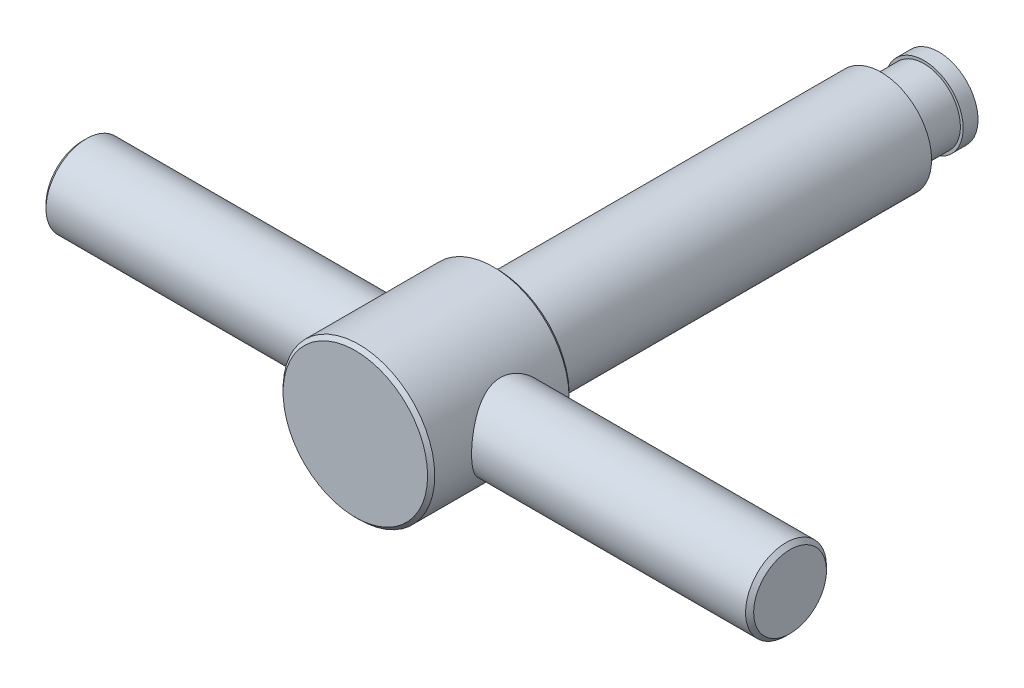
ISO-10303-21;
HEADER;
FILE_DESCRIPTION(('STEP AP214'),'2;1');
FILE_NAME('part.step','',(''),(''),'','','');
FILE_SCHEMA(('AUTOMOTIVE_DESIGN { 1 0 10303 214 1 1 1 1 }'));
ENDSEC;
DATA;
#1=APPLICATION_CONTEXT('core data for automotive mechanical design processes');
#2=APPLICATION_PROTOCOL_DEFINITION('international standard','automotive_design',2000,#1);
#3=PRODUCT_CONTEXT('',#1,'mechanical');
#4=PRODUCT('Part','Part','',(#3));
#5=PRODUCT_RELATED_PRODUCT_CATEGORY('part','',(#4));
#6=PRODUCT_DEFINITION_FORMATION('','',#4);
#7=PRODUCT_DEFINITION_CONTEXT('part definition',#1,'design');
#8=PRODUCT_DEFINITION('design','',#6,#7);
#9=PRODUCT_DEFINITION_SHAPE('','',#8);
#10=(LENGTH_UNIT() NAMED_UNIT(*) SI_UNIT(.MILLI.,.METRE.));
#11=(NAMED_UNIT(*) PLANE_ANGLE_UNIT() SI_UNIT($,.RADIAN.));
#12=(NAMED_UNIT(*) SI_UNIT($,.STERADIAN.) SOLID_ANGLE_UNIT());
#13=UNCERTAINTY_MEASURE_WITH_UNIT(LENGTH_MEASURE(1.E-05),#10,'distance_accuracy_value','');
#14=(GEOMETRIC_REPRESENTATION_CONTEXT(3) GLOBAL_UNCERTAINTY_ASSIGNED_CONTEXT((#13)) GLOBAL_UNIT_ASSIGNED_CONTEXT((#10,
#11,#12)) REPRESENTATION_CONTEXT('',''));
#15=CARTESIAN_POINT('',(0.,0.,0.));
#16=DIRECTION('',(0.,0.,1.));
#17=DIRECTION('',(1.,0.,0.));
#18=AXIS2_PLACEMENT_3D('',#15,#16,#17);
#19=CARTESIAN_POINT('',(70.,0.,109.2));
#20=DIRECTION('',(-1.,0.,0.));
#21=DIRECTION('',(0.,-1.,0.));
#22=AXIS2_PLACEMENT_3D('',#19,#20,#21);
#23=PLANE('',#22);
#24=CARTESIAN_POINT('',(70.,0.,102.));
#25=DIRECTION('',(-1.,0.,0.));
#26=DIRECTION('',(0.,-1.,0.));
#27=AXIS2_PLACEMENT_3D('',#24,#25,#26);
#28=CIRCLE('',#27,7.2);
#29=CARTESIAN_POINT('',(70.,-7.2,102.));
#30=VERTEX_POINT('',#29);
#31=EDGE_CURVE('E15',#30,#30,#28,.T.);
#32=ORIENTED_EDGE('',*,*,#31,.F.);
#33=EDGE_LOOP('',(#32));
#34=FACE_BOUND('',#33,.T.);
#35=ADVANCED_FACE('F12',(#34),#23,.F.);
#36=CARTESIAN_POINT('',(-70.,0.,102.));
#37=DIRECTION('',(1.,0.,0.));
#38=DIRECTION('',(0.,1.,0.));
#39=AXIS2_PLACEMENT_3D('',#36,#37,#38);
#40=PLANE('',#39);
#41=CARTESIAN_POINT('',(-70.,0.,102.));
#42=DIRECTION('',(1.,0.,0.));
#43=DIRECTION('',(0.,1.,0.));
#44=AXIS2_PLACEMENT_3D('',#41,#42,#43);
#45=CIRCLE('',#44,7.2);
#46=CARTESIAN_POINT('',(-70.,7.2,102.));
#47=VERTEX_POINT('',#46);
#48=EDGE_CURVE('E130',#47,#47,#45,.T.);
#49=ORIENTED_EDGE('',*,*,#48,.F.);
#50=EDGE_LOOP('',(#49));
#51=FACE_BOUND('',#50,.T.);
#52=ADVANCED_FACE('F167',(#51),#40,.F.);
#53=CARTESIAN_POINT('',(0.,0.,13.));
#54=DIRECTION('',(-1.,0.,0.));
#55=DIRECTION('',(0.,1.,0.));
#56=AXIS2_PLACEMENT_3D('',#53,#54,#55);
#57=SPHERICAL_SURFACE('',#56,13.);
#58=CARTESIAN_POINT('',(0.,0.,2.56268712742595));
#59=DIRECTION('',(0.,0.,1.));
#60=DIRECTION('',(0.,-1.,0.));
#61=AXIS2_PLACEMENT_3D('',#58,#59,#60);
#62=CIRCLE('',#61,7.75);
#63=CARTESIAN_POINT('',(0.,-7.75,2.56268712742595));
#64=VERTEX_POINT('',#63);
#65=EDGE_CURVE('E123',#64,#64,#62,.T.);
#66=ORIENTED_EDGE('',*,*,#65,.F.);
#67=EDGE_LOOP('',(#66));
#68=FACE_BOUND('',#67,.T.);
#69=ADVANCED_FACE('F164',(#68),#57,.T.);
#70=CARTESIAN_POINT('',(69.2,0.,102.));
#71=DIRECTION('',(-1.,0.,0.));
#72=DIRECTION('',(0.,-1.,0.));
#73=AXIS2_PLACEMENT_3D('',#70,#71,#72);
#74=CONICAL_SURFACE('',#73,8.,0.785398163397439);
#75=CARTESIAN_POINT('',(69.2,0.,102.));
#76=DIRECTION('',(-1.,0.,0.));
#77=DIRECTION('',(0.,-1.,0.));
#78=AXIS2_PLACEMENT_3D('',#75,#76,#77);
#79=CIRCLE('',#78,8.);
#80=CARTESIAN_POINT('',(69.2,-8.,102.));
#81=VERTEX_POINT('',#80);
#82=EDGE_CURVE('E121',#81,#81,#79,.T.);
#83=ORIENTED_EDGE('',*,*,#82,.F.);
#84=EDGE_LOOP('',(#83));
#85=FACE_BOUND('',#84,.T.);
#86=ORIENTED_EDGE('',*,*,#31,.T.);
#87=EDGE_LOOP('',(#86));
#88=FACE_BOUND('',#87,.T.);
#89=ADVANCED_FACE('F160',(#85,#88),#74,.T.);
#90=CARTESIAN_POINT('',(0.,0.,118.));
#91=DIRECTION('',(0.,0.,-1.));
#92=DIRECTION('',(0.,1.,0.));
#93=AXIS2_PLACEMENT_3D('',#90,#91,#92);
#94=PLANE('',#93);
#95=CARTESIAN_POINT('',(0.,0.,118.));
#96=DIRECTION('',(0.,0.,-1.));
#97=DIRECTION('',(1.,0.,0.));
#98=AXIS2_PLACEMENT_3D('',#95,#96,#97);
#99=CIRCLE('',#98,14.2928932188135);
#100=CARTESIAN_POINT('',(14.2928932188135,0.,118.));
#101=VERTEX_POINT('',#100);
#102=EDGE_CURVE('E118',#101,#101,#99,.T.);
#103=ORIENTED_EDGE('',*,*,#102,.F.);
#104=EDGE_LOOP('',(#103));
#105=FACE_BOUND('',#104,.T.);
#106=ADVANCED_FACE('F156',(#105),#94,.F.);
#107=CARTESIAN_POINT('',(-69.2,0.,102.));
#108=DIRECTION('',(1.,0.,0.));
#109=DIRECTION('',(0.,1.,0.));
#110=AXIS2_PLACEMENT_3D('',#107,#108,#109);
#111=CONICAL_SURFACE('',#110,8.,0.785398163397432);
#112=ORIENTED_EDGE('',*,*,#48,.T.);
#113=EDGE_LOOP('',(#112));
#114=FACE_BOUND('',#113,.T.);
#115=CARTESIAN_POINT('',(-69.2,0.,102.));
#116=DIRECTION('',(-1.,0.,0.));
#117=DIRECTION('',(0.,-1.,0.));
#118=AXIS2_PLACEMENT_3D('',#115,#116,#117);
#119=CIRCLE('',#118,8.);
#120=CARTESIAN_POINT('',(-69.2,-8.,102.));
#121=VERTEX_POINT('',#120);
#122=EDGE_CURVE('E114',#121,#121,#119,.F.);
#123=ORIENTED_EDGE('',*,*,#122,.F.);
#124=EDGE_LOOP('',(#123));
#125=FACE_BOUND('',#124,.T.);
#126=ADVANCED_FACE('F150',(#114,#125),#111,.T.);
#127=CARTESIAN_POINT('',(0.,0.,0.));
#128=DIRECTION('',(0.,0.,1.));
#129=DIRECTION('',(0.,-1.,0.));
#130=AXIS2_PLACEMENT_3D('',#127,#128,#129);
#131=CYLINDRICAL_SURFACE('',#130,7.75);
#132=CARTESIAN_POINT('',(0.,0.,5.5));
#133=DIRECTION('',(0.,0.,1.));
#134=DIRECTION('',(0.,-1.,0.));
#135=AXIS2_PLACEMENT_3D('',#132,#133,#134);
#136=CIRCLE('',#135,7.75);
#137=CARTESIAN_POINT('',(0.,-7.75,5.5));
#138=VERTEX_POINT('',#137);
#139=EDGE_CURVE('E117',#138,#138,#136,.F.);
#140=ORIENTED_EDGE('',*,*,#139,.T.);
#141=EDGE_LOOP('',(#140));
#142=FACE_BOUND('',#141,.T.);
#143=ORIENTED_EDGE('',*,*,#65,.T.);
#144=EDGE_LOOP('',(#143));
#145=FACE_BOUND('',#144,.T.);
#146=ADVANCED_FACE('F144',(#142,#145),#131,.T.);
#147=CARTESIAN_POINT('',(70.,0.,102.));
#148=DIRECTION('',(-1.,0.,0.));
#149=DIRECTION('',(0.,-1.,0.));
#150=AXIS2_PLACEMENT_3D('',#147,#148,#149);
#151=CYLINDRICAL_SURFACE('',#150,8.);
#152=CARTESIAN_POINT('',(12.689294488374,7.99886275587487,101.86511259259));
#153=CARTESIAN_POINT('',(12.6915005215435,7.99536276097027,101.657535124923));
#154=CARTESIAN_POINT('',(12.698815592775,7.98377231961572,101.4501531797));
#155=CARTESIAN_POINT('',(12.7233681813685,7.94458516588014,101.037422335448));
#156=CARTESIAN_POINT('',(12.7406097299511,7.91698195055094,100.832074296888));
#157=CARTESIAN_POINT('',(12.7843716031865,7.84611824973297,100.424812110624));
#158=CARTESIAN_POINT('',(12.8109052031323,7.80283536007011,100.22290331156));
#159=CARTESIAN_POINT('',(12.8722778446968,7.7011676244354,99.8241368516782));
#160=CARTESIAN_POINT('',(12.9071206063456,7.64277601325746,99.6272814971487));
#161=CARTESIAN_POINT('',(12.983665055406,7.51199941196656,99.2411706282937));
#162=CARTESIAN_POINT('',(13.0253198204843,7.43970959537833,99.0518734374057));
#163=CARTESIAN_POINT('',(13.1143932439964,7.28154717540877,98.680383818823));
#164=CARTESIAN_POINT('',(13.1618139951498,7.19566963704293,98.4981940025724));
#165=CARTESIAN_POINT('',(13.2610944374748,7.01101575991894,98.141772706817));
#166=CARTESIAN_POINT('',(13.3129533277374,6.91224174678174,97.9675398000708));
#167=CARTESIAN_POINT('',(13.4197993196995,6.70245383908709,97.6276958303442));
#168=CARTESIAN_POINT('',(13.4747865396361,6.59143948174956,97.4620850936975));
#169=CARTESIAN_POINT('',(13.6534578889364,6.2180081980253,96.9475959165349));
#170=CARTESIAN_POINT('',(13.7808278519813,5.93298555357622,96.6158151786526));
#171=CARTESIAN_POINT('',(13.9689823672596,5.46769874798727,96.1560269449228));
#172=CARTESIAN_POINT('',(14.0312550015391,5.30619866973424,96.0089982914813));
#173=CARTESIAN_POINT('',(14.1534426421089,4.97109760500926,95.7281643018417));
#174=CARTESIAN_POINT('',(14.2133572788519,4.79749473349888,95.5943610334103));
#175=CARTESIAN_POINT('',(14.3333751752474,4.42661700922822,95.3321545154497));
#176=CARTESIAN_POINT('',(14.3932045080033,4.22853538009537,95.2047658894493));
#177=CARTESIAN_POINT('',(14.5067990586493,3.82067538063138,94.9673562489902));
#178=CARTESIAN_POINT('',(14.5605669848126,3.61090229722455,94.8573274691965));
#179=CARTESIAN_POINT('',(14.6604907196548,3.18098894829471,94.6557745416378));
#180=CARTESIAN_POINT('',(14.7066493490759,2.96085256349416,94.5642435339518));
#181=CARTESIAN_POINT('',(14.7899668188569,2.51177337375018,94.4007850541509));
#182=CARTESIAN_POINT('',(14.8271268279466,2.28283171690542,94.3288550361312));
#183=CARTESIAN_POINT('',(14.8884993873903,1.83808610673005,94.2109230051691));
#184=CARTESIAN_POINT('',(14.9135510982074,1.62284762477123,94.1632221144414));
#185=CARTESIAN_POINT('',(14.9544481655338,1.18831227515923,94.0856706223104));
#186=CARTESIAN_POINT('',(14.9702940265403,0.969015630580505,94.0558190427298));
#187=CARTESIAN_POINT('',(14.9923149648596,0.528336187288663,94.0143994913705));
#188=CARTESIAN_POINT('',(14.9984951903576,0.306954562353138,94.0028217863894));
#189=CARTESIAN_POINT('',(15.0010180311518,-0.136055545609,93.9980909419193));
#190=CARTESIAN_POINT('',(14.9973612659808,-0.357684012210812,94.0049366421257));
#191=CARTESIAN_POINT('',(14.981126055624,-0.778417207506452,94.0354359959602));
#192=CARTESIAN_POINT('',(14.9694202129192,-0.977677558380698,94.0574460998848));
#193=CARTESIAN_POINT('',(14.9383067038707,-1.37346486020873,94.116242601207));
#194=CARTESIAN_POINT('',(14.9188964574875,-1.56999087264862,94.1530339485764));
#195=CARTESIAN_POINT('',(14.8728340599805,-1.95886060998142,94.2409669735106));
#196=CARTESIAN_POINT('',(14.8461843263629,-2.15120570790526,94.2921038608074));
#197=CARTESIAN_POINT('',(14.7862300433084,-2.53067624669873,94.4082235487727));
#198=CARTESIAN_POINT('',(14.7529229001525,-2.71779962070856,94.4732117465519));
#199=CARTESIAN_POINT('',(14.6796612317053,-3.08935153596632,94.617830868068));
#200=CARTESIAN_POINT('',(14.6395886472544,-3.27365430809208,94.6977251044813));
#201=CARTESIAN_POINT('',(14.5541371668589,-3.63477338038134,94.8705866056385));
#202=CARTESIAN_POINT('',(14.5087564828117,-3.81158713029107,94.9635582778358));
#203=CARTESIAN_POINT('',(14.366052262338,-4.32949358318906,95.2610182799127));
#204=CARTESIAN_POINT('',(14.2621230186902,-4.65826391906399,95.4841350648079));
#205=CARTESIAN_POINT('',(14.0332510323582,-5.31033875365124,96.0007245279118));
#206=CARTESIAN_POINT('',(13.9072489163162,-5.62934769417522,96.2991547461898));
#207=CARTESIAN_POINT('',(13.7186181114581,-6.06836546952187,96.7824852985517));
#208=CARTESIAN_POINT('',(13.6557521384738,-6.20821998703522,96.9496939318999));
#209=CARTESIAN_POINT('',(13.5316987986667,-6.4741501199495,97.2954360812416));
#210=CARTESIAN_POINT('',(13.4705117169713,-6.60022340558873,97.4739715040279));
#211=CARTESIAN_POINT('',(13.3471818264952,-6.84638984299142,97.8548783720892));
#212=CARTESIAN_POINT('',(13.2852906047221,-6.96538902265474,98.0580396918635));
#213=CARTESIAN_POINT('',(13.167502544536,-7.18557329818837,98.4753502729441));
#214=CARTESIAN_POINT('',(13.1116028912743,-7.28676677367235,98.6894943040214));
#215=CARTESIAN_POINT('',(13.0079356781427,-7.47025544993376,99.1274405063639));
#216=CARTESIAN_POINT('',(12.9601615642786,-7.55256590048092,99.351234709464));
#217=CARTESIAN_POINT('',(12.8747418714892,-7.69727883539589,99.8070470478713));
#218=CARTESIAN_POINT('',(12.8370945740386,-7.7596846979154,100.039063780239));
#219=CARTESIAN_POINT('',(12.7766247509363,-7.85881118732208,100.487742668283));
#220=CARTESIAN_POINT('',(12.7527587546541,-7.89736348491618,100.703859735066));
#221=CARTESIAN_POINT('',(12.715875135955,-7.95661670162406,101.139450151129));
#222=CARTESIAN_POINT('',(12.7028567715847,-7.97731884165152,101.358923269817));
#223=CARTESIAN_POINT('',(12.6882634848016,-8.00050992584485,101.799062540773));
#224=CARTESIAN_POINT('',(12.6866808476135,-8.00301114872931,102.019727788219));
#225=CARTESIAN_POINT('',(12.6950135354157,-7.98978692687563,102.46028233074));
#226=CARTESIAN_POINT('',(12.7049279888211,-7.97406286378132,102.680171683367));
#227=CARTESIAN_POINT('',(12.7338390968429,-7.92779706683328,103.089466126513));
#228=CARTESIAN_POINT('',(12.7515286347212,-7.89938068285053,103.279209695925));
#229=CARTESIAN_POINT('',(12.7947377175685,-7.82920080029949,103.655364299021));
#230=CARTESIAN_POINT('',(12.8202598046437,-7.78743296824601,103.841774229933));
#231=CARTESIAN_POINT('',(12.8783315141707,-7.69101670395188,104.210089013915));
#232=CARTESIAN_POINT('',(12.910880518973,-7.63636940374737,104.391994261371));
#233=CARTESIAN_POINT('',(12.982063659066,-7.51471774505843,104.750433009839));
#234=CARTESIAN_POINT('',(13.0207002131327,-7.44770847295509,104.926964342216));
#235=CARTESIAN_POINT('',(13.1488722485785,-7.22069987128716,105.466897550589));
#236=CARTESIAN_POINT('',(13.2472287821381,-7.04015992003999,105.819794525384));
#237=CARTESIAN_POINT('',(13.4565981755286,-6.63118330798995,106.492508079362));
#238=CARTESIAN_POINT('',(13.5676179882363,-6.40272027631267,106.812306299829));
#239=CARTESIAN_POINT('',(13.7446246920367,-6.0091681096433,107.285855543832));
#240=CARTESIAN_POINT('',(13.8096255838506,-5.85860208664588,107.452258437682));
#241=CARTESIAN_POINT('',(13.9389400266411,-5.54390231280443,107.77195170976));
#242=CARTESIAN_POINT('',(14.0032537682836,-5.37977244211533,107.925245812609));
#243=CARTESIAN_POINT('',(14.1296197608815,-5.03854925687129,108.218006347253));
#244=CARTESIAN_POINT('',(14.1916701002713,-4.86144534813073,108.357461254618));
#245=CARTESIAN_POINT('',(14.3118643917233,-4.49529134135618,108.6214246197));
#246=CARTESIAN_POINT('',(14.370010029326,-4.30624646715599,108.745939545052));
#247=CARTESIAN_POINT('',(14.4826332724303,-3.91111396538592,108.98268149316));
#248=CARTESIAN_POINT('',(14.5369434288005,-3.70468126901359,109.094413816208));
#249=CARTESIAN_POINT('',(14.638318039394,-3.28131316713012,109.29988650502));
#250=CARTESIAN_POINT('',(14.6853822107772,-3.06437735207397,109.393626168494));
#251=CARTESIAN_POINT('',(14.7708257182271,-2.62172979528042,109.561914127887));
#252=CARTESIAN_POINT('',(14.8092123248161,-2.39602558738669,109.636478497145));
#253=CARTESIAN_POINT('',(14.8761439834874,-1.93752040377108,109.765481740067));
#254=CARTESIAN_POINT('',(14.9046904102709,-1.70472042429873,109.819923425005));
#255=CARTESIAN_POINT('',(14.9486186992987,-1.25847496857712,109.903310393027));
#256=CARTESIAN_POINT('',(14.9650560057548,-1.04551498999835,109.934308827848));
#257=CARTESIAN_POINT('',(14.9888266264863,-0.61728844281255,109.97905300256));
#258=CARTESIAN_POINT('',(14.9961605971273,-0.402022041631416,109.992799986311));
#259=CARTESIAN_POINT('',(15.0015197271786,0.028960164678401,110.002850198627));
#260=CARTESIAN_POINT('',(14.9995479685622,0.244675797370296,109.999159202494));
#261=CARTESIAN_POINT('',(14.986357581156,0.674817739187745,109.974398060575));
#262=CARTESIAN_POINT('',(14.9751392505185,0.889244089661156,109.953328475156));
#263=CARTESIAN_POINT('',(14.9449461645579,1.29907532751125,109.896325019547));
#264=CARTESIAN_POINT('',(14.9266159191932,1.49470112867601,109.861623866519));
#265=CARTESIAN_POINT('',(14.8827292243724,1.88212313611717,109.777975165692));
#266=CARTESIAN_POINT('',(14.8571703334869,2.07391802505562,109.729022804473));
#267=CARTESIAN_POINT('',(14.7994088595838,2.45237301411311,109.617399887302));
#268=CARTESIAN_POINT('',(14.7672082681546,2.63903463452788,109.554733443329));
#269=CARTESIAN_POINT('',(14.6968369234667,3.00632106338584,109.416237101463));
#270=CARTESIAN_POINT('',(14.6586638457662,3.18694348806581,109.340402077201));
#271=CARTESIAN_POINT('',(14.5753142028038,3.54912314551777,109.172539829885));
#272=CARTESIAN_POINT('',(14.5299005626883,3.73036002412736,109.079939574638));
#273=CARTESIAN_POINT('',(14.4343837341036,4.08438470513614,108.881785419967));
#274=CARTESIAN_POINT('',(14.3842789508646,4.25716960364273,108.776227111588));
#275=CARTESIAN_POINT('',(14.2804213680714,4.59353407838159,108.552878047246));
#276=CARTESIAN_POINT('',(14.2266678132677,4.75711173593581,108.435084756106));
#277=CARTESIAN_POINT('',(14.1166098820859,5.07439931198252,108.187965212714));
#278=CARTESIAN_POINT('',(14.0603053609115,5.228108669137,108.058638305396));
#279=CARTESIAN_POINT('',(13.9399234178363,5.5416406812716,107.774070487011));
#280=CARTESIAN_POINT('',(13.8756786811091,5.70023771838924,107.617547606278));
#281=CARTESIAN_POINT('',(13.7470505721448,6.00381408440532,107.291859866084));
#282=CARTESIAN_POINT('',(13.6826671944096,6.14879286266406,107.122694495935));
#283=CARTESIAN_POINT('',(13.5553846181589,6.42453340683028,106.772327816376));
#284=CARTESIAN_POINT('',(13.4924869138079,6.55528130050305,106.591115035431));
#285=CARTESIAN_POINT('',(13.369992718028,6.80163406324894,106.217563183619));
#286=CARTESIAN_POINT('',(13.3103967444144,6.91723656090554,106.025222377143));
#287=CARTESIAN_POINT('',(13.1937787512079,7.13725424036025,105.621436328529));
#288=CARTESIAN_POINT('',(13.1369921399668,7.24093489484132,105.409521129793));
#289=CARTESIAN_POINT('',(13.0311666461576,7.42969787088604,104.975816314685));
#290=CARTESIAN_POINT('',(12.9821236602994,7.5147900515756,104.754032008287));
#291=CARTESIAN_POINT('',(12.893911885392,7.66515673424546,104.302569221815));
#292=CARTESIAN_POINT('',(12.85471792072,7.73048185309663,104.072912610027));
#293=CARTESIAN_POINT('',(12.787887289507,7.84054245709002,103.607196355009));
#294=CARTESIAN_POINT('',(12.7602428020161,7.88529187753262,103.371141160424));
#295=CARTESIAN_POINT('',(12.7204492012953,7.94930196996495,102.923741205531));
#296=CARTESIAN_POINT('',(12.7068270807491,7.97099628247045,102.712872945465));
#297=CARTESIAN_POINT('',(12.6901221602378,7.99756562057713,102.289639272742));
#298=CARTESIAN_POINT('',(12.6870397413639,8.00244003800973,102.077273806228));
#299=CARTESIAN_POINT('',(12.689294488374,7.99886275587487,101.86511259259));
#300=B_SPLINE_CURVE_WITH_KNOTS('',3,(#152,#153,#154,#155,#156,#157,#158,#159,#160,#161,#162,
#163,#164,#165,#166,#167,#168,#169,#170,#171,#172,#173,#174,#175,#176,#177,#178,#179,#180,#181,
#182,#183,#184,#185,#186,#187,#188,#189,#190,#191,#192,#193,#194,#195,#196,#197,#198,#199,#200,
#201,#202,#203,#204,#205,#206,#207,#208,#209,#210,#211,#212,#213,#214,#215,#216,#217,#218,#219,
#220,#221,#222,#223,#224,#225,#226,#227,#228,#229,#230,#231,#232,#233,#234,#235,#236,#237,#238,
#239,#240,#241,#242,#243,#244,#245,#246,#247,#248,#249,#250,#251,#252,#253,#254,#255,#256,#257,
#258,#259,#260,#261,#262,#263,#264,#265,#266,#267,#268,#269,#270,#271,#272,#273,#274,#275,#276,
#277,#278,#279,#280,#281,#282,#283,#284,#285,#286,#287,#288,#289,#290,#291,#292,#293,#294,#295,
#296,#297,#298,#299),.UNSPECIFIED.,.T.,.F.,(4,2,2,2,2,2,2,2,2,2,2,2,2,2,2,2,2,2,2,2,2,2,2,2,2,2,
2,2,2,2,2,2,2,2,2,2,2,2,2,2,2,2,2,2,2,2,2,2,2,2,2,2,2,2,2,2,2,2,2,2,2,2,2,2,2,2,2,2,2,2,2,2,2,
4),(0.,0.622631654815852,1.24551634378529,1.86929458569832,2.49335262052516,3.1132803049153,
3.73343366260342,4.35347534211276,4.97354047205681,6.3334333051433,7.01422801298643,
7.69512899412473,8.42315420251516,9.15085282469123,9.87828108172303,10.6056148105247,
11.270340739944,11.9350302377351,12.599365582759,13.2636590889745,13.8653947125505,
14.4673320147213,15.069068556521,15.6710399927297,16.2848738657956,16.8989151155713,
18.1263080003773,19.484165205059,20.1642035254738,20.844356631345,21.5737574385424,
22.3028140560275,23.0312798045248,23.7596218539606,24.4211187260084,25.0825703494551,
25.743575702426,26.4045309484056,26.981900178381,27.5594569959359,28.1369630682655,
28.7146991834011,29.9349233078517,31.155820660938,31.8560597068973,32.5560991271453,
33.2567166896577,33.9570298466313,34.6788463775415,35.400691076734,36.1219287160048,
36.843065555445,37.4896930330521,38.1362738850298,38.7826406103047,39.4289864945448,
40.0268786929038,40.6249730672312,41.2228883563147,41.8210369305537,42.4459714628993,
43.071119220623,43.6963967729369,44.321709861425,45.0166630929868,45.7116444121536,
46.4072972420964,47.1030588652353,47.8300331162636,48.5566208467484,49.2813319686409,
50.0055515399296,50.6419091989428,51.2782898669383),.UNSPECIFIED.);
#301=CARTESIAN_POINT('',(12.689294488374,7.99886275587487,101.86511259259));
#302=VERTEX_POINT('',#301);
#303=EDGE_CURVE('E46',#302,#302,#300,.T.);
#304=ORIENTED_EDGE('',*,*,#303,.F.);
#305=EDGE_LOOP('',(#304));
#306=FACE_BOUND('',#305,.T.);
#307=ORIENTED_EDGE('',*,*,#82,.T.);
#308=EDGE_LOOP('',(#307));
#309=FACE_BOUND('',#308,.T.);
#310=ADVANCED_FACE('F142',(#306,#309),#151,.T.);
#311=CARTESIAN_POINT('',(0.,0.,117.292893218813));
#312=DIRECTION('',(0.,0.,-1.));
#313=DIRECTION('',(1.,0.,0.));
#314=AXIS2_PLACEMENT_3D('',#311,#312,#313);
#315=CONICAL_SURFACE('',#314,15.0000000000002,0.785398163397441);
#316=ORIENTED_EDGE('',*,*,#102,.T.);
#317=EDGE_LOOP('',(#316));
#318=FACE_BOUND('',#317,.T.);
#319=CARTESIAN_POINT('',(0.,0.,117.292893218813));
#320=DIRECTION('',(0.,0.,1.));
#321=DIRECTION('',(0.,-1.,0.));
#322=AXIS2_PLACEMENT_3D('',#319,#320,#321);
#323=CIRCLE('',#322,15.);
#324=CARTESIAN_POINT('',(0.,-15.,117.292893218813));
#325=VERTEX_POINT('',#324);
#326=EDGE_CURVE('E45',#325,#325,#323,.F.);
#327=ORIENTED_EDGE('',*,*,#326,.F.);
#328=EDGE_LOOP('',(#327));
#329=FACE_BOUND('',#328,.T.);
#330=ADVANCED_FACE('F71',(#318,#329),#315,.T.);
#331=CARTESIAN_POINT('',(70.,0.,102.));
#332=DIRECTION('',(-1.,0.,0.));
#333=DIRECTION('',(0.,-1.,0.));
#334=AXIS2_PLACEMENT_3D('',#331,#332,#333);
#335=CYLINDRICAL_SURFACE('',#334,8.);
#336=ORIENTED_EDGE('',*,*,#122,.T.);
#337=EDGE_LOOP('',(#336));
#338=FACE_BOUND('',#337,.T.);
#339=CARTESIAN_POINT('',(-12.689294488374,7.99886275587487,102.13488740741));
#340=CARTESIAN_POINT('',(-12.6915005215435,7.99536276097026,102.342464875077));
#341=CARTESIAN_POINT('',(-12.698815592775,7.98377231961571,102.5498468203));
#342=CARTESIAN_POINT('',(-12.7233681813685,7.94458516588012,102.962577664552));
#343=CARTESIAN_POINT('',(-12.7406097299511,7.91698195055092,103.167925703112));
#344=CARTESIAN_POINT('',(-12.7843716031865,7.84611824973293,103.575187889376));
#345=CARTESIAN_POINT('',(-12.8109052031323,7.80283536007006,103.77709668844));
#346=CARTESIAN_POINT('',(-12.8722778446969,7.70116762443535,104.175863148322));
#347=CARTESIAN_POINT('',(-12.9071206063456,7.64277601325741,104.372718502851));
#348=CARTESIAN_POINT('',(-12.983665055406,7.51199941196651,104.758829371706));
#349=CARTESIAN_POINT('',(-13.0253198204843,7.43970959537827,104.948126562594));
#350=CARTESIAN_POINT('',(-13.1143932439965,7.28154717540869,105.319616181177));
#351=CARTESIAN_POINT('',(-13.1618139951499,7.19566963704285,105.501805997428));
#352=CARTESIAN_POINT('',(-13.2610944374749,7.01101575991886,105.858227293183));
#353=CARTESIAN_POINT('',(-13.3129533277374,6.91224174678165,106.032460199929));
#354=CARTESIAN_POINT('',(-13.4197993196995,6.70245383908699,106.372304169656));
#355=CARTESIAN_POINT('',(-13.4747865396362,6.59143948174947,106.537914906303));
#356=CARTESIAN_POINT('',(-13.6534578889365,6.21800819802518,107.052404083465));
#357=CARTESIAN_POINT('',(-13.7808278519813,5.9329855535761,107.384184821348));
#358=CARTESIAN_POINT('',(-13.9689823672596,5.46769874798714,107.843973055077));
#359=CARTESIAN_POINT('',(-14.0312550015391,5.3061986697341,107.991001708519));
#360=CARTESIAN_POINT('',(-14.153442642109,4.9710976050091,108.271835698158));
#361=CARTESIAN_POINT('',(-14.2133572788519,4.79749473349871,108.40563896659));
#362=CARTESIAN_POINT('',(-14.3333751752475,4.42661700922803,108.66784548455));
#363=CARTESIAN_POINT('',(-14.3932045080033,4.22853538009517,108.795234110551));
#364=CARTESIAN_POINT('',(-14.5067990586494,3.82067538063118,109.03264375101));
#365=CARTESIAN_POINT('',(-14.5605669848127,3.61090229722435,109.142672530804));
#366=CARTESIAN_POINT('',(-14.6604907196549,3.18098894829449,109.344225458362));
#367=CARTESIAN_POINT('',(-14.706649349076,2.96085256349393,109.435756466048));
#368=CARTESIAN_POINT('',(-14.789966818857,2.51177337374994,109.599214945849));
#369=CARTESIAN_POINT('',(-14.8271268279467,2.2828317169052,109.671144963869));
#370=CARTESIAN_POINT('',(-14.8884993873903,1.83808610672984,109.789076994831));
#371=CARTESIAN_POINT('',(-14.9135510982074,1.62284762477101,109.836777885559));
#372=CARTESIAN_POINT('',(-14.9544481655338,1.18831227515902,109.91432937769));
#373=CARTESIAN_POINT('',(-14.9702940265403,0.9690156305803,109.94418095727));
#374=CARTESIAN_POINT('',(-14.9923149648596,0.528336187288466,109.985600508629));
#375=CARTESIAN_POINT('',(-14.9984951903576,0.306954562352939,109.997178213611));
#376=CARTESIAN_POINT('',(-15.0010180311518,-0.136055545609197,110.001909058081));
#377=CARTESIAN_POINT('',(-14.9973612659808,-0.357684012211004,109.995063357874));
#378=CARTESIAN_POINT('',(-14.981126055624,-0.778417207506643,109.96456400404));
#379=CARTESIAN_POINT('',(-14.9694202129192,-0.977677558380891,109.942553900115));
#380=CARTESIAN_POINT('',(-14.9383067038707,-1.37346486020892,109.883757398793));
#381=CARTESIAN_POINT('',(-14.9188964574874,-1.56999087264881,109.846966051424));
#382=CARTESIAN_POINT('',(-14.8728340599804,-1.95886060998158,109.759033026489));
#383=CARTESIAN_POINT('',(-14.8461843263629,-2.1512057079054,109.707896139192));
#384=CARTESIAN_POINT('',(-14.7862300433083,-2.53067624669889,109.591776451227));
#385=CARTESIAN_POINT('',(-14.7529229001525,-2.71779962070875,109.526788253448));
#386=CARTESIAN_POINT('',(-14.6796612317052,-3.08935153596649,109.382169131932));
#387=CARTESIAN_POINT('',(-14.6395886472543,-3.27365430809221,109.302274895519));
#388=CARTESIAN_POINT('',(-14.5541371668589,-3.63477338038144,109.129413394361));
#389=CARTESIAN_POINT('',(-14.5087564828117,-3.81158713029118,109.036441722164));
#390=CARTESIAN_POINT('',(-14.366052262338,-4.3294935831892,108.738981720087));
#391=CARTESIAN_POINT('',(-14.2621230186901,-4.65826391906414,108.515864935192));
#392=CARTESIAN_POINT('',(-14.0332510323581,-5.3103387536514,107.999275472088));
#393=CARTESIAN_POINT('',(-13.9072489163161,-5.62934769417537,107.70084525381));
#394=CARTESIAN_POINT('',(-13.718618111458,-6.06836546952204,107.217514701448));
#395=CARTESIAN_POINT('',(-13.6557521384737,-6.20821998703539,107.0503060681));
#396=CARTESIAN_POINT('',(-13.5316987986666,-6.47415011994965,106.704563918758));
#397=CARTESIAN_POINT('',(-13.4705117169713,-6.60022340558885,106.526028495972));
#398=CARTESIAN_POINT('',(-13.3471818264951,-6.84638984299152,106.145121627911));
#399=CARTESIAN_POINT('',(-13.285290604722,-6.96538902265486,105.941960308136));
#400=CARTESIAN_POINT('',(-13.1675025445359,-7.18557329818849,105.524649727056));
#401=CARTESIAN_POINT('',(-13.1116028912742,-7.28676677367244,105.310505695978));
#402=CARTESIAN_POINT('',(-13.0079356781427,-7.4702554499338,104.872559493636));
#403=CARTESIAN_POINT('',(-12.9601615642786,-7.55256590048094,104.648765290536));
#404=CARTESIAN_POINT('',(-12.8747418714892,-7.69727883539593,104.192952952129));
#405=CARTESIAN_POINT('',(-12.8370945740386,-7.75968469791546,103.960936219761));
#406=CARTESIAN_POINT('',(-12.7766247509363,-7.85881118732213,103.512257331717));
#407=CARTESIAN_POINT('',(-12.7527587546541,-7.8973634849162,103.296140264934));
#408=CARTESIAN_POINT('',(-12.715875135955,-7.95661670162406,102.86054984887));
#409=CARTESIAN_POINT('',(-12.7028567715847,-7.97731884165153,102.641076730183));
#410=CARTESIAN_POINT('',(-12.6882634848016,-8.00050992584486,102.200937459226));
#411=CARTESIAN_POINT('',(-12.6866808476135,-8.00301114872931,101.980272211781));
#412=CARTESIAN_POINT('',(-12.6950135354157,-7.98978692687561,101.53971766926));
#413=CARTESIAN_POINT('',(-12.7049279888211,-7.97406286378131,101.319828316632));
#414=CARTESIAN_POINT('',(-12.7338390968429,-7.92779706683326,100.910533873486));
#415=CARTESIAN_POINT('',(-12.7515286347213,-7.89938068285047,100.720790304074));
#416=CARTESIAN_POINT('',(-12.7947377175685,-7.82920080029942,100.344635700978));
#417=CARTESIAN_POINT('',(-12.8202598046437,-7.78743296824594,100.158225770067));
#418=CARTESIAN_POINT('',(-12.8783315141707,-7.69101670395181,99.7899109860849));
#419=CARTESIAN_POINT('',(-12.910880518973,-7.63636940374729,99.6080057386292));
#420=CARTESIAN_POINT('',(-12.982063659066,-7.51471774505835,99.2495669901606));
#421=CARTESIAN_POINT('',(-13.0207002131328,-7.44770847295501,99.0730356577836));
#422=CARTESIAN_POINT('',(-13.1488722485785,-7.22069987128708,98.5331024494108));
#423=CARTESIAN_POINT('',(-13.2472287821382,-7.04015992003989,98.1802054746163));
#424=CARTESIAN_POINT('',(-13.4565981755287,-6.63118330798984,97.5074919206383));
#425=CARTESIAN_POINT('',(-13.5676179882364,-6.40272027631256,97.1876937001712));
#426=CARTESIAN_POINT('',(-13.7446246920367,-6.00916810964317,96.7141444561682));
#427=CARTESIAN_POINT('',(-13.8096255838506,-5.85860208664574,96.5477415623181));
#428=CARTESIAN_POINT('',(-13.9389400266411,-5.54390231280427,96.2280482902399));
#429=CARTESIAN_POINT('',(-14.0032537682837,-5.37977244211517,96.0747541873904));
#430=CARTESIAN_POINT('',(-14.1296197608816,-5.03854925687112,95.7819936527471));
#431=CARTESIAN_POINT('',(-14.1916701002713,-4.86144534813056,95.6425387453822));
#432=CARTESIAN_POINT('',(-14.3118643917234,-4.49529134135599,95.3785753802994));
#433=CARTESIAN_POINT('',(-14.3700100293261,-4.30624646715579,95.2540604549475));
#434=CARTESIAN_POINT('',(-14.4826332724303,-3.91111396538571,95.0173185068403));
#435=CARTESIAN_POINT('',(-14.5369434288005,-3.70468126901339,94.9055861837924));
#436=CARTESIAN_POINT('',(-14.638318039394,-3.28131316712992,94.7001134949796));
#437=CARTESIAN_POINT('',(-14.6853822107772,-3.06437735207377,94.606373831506));
#438=CARTESIAN_POINT('',(-14.7708257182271,-2.62172979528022,94.4380858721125));
#439=CARTESIAN_POINT('',(-14.8092123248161,-2.3960255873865,94.3635215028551));
#440=CARTESIAN_POINT('',(-14.8761439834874,-1.93752040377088,94.2345182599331));
#441=CARTESIAN_POINT('',(-14.9046904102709,-1.70472042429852,94.1800765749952));
#442=CARTESIAN_POINT('',(-14.9486186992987,-1.2584749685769,94.0966896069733));
#443=CARTESIAN_POINT('',(-14.9650560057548,-1.04551498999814,94.065691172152));
#444=CARTESIAN_POINT('',(-14.9888266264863,-0.617288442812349,94.0209469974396));
#445=CARTESIAN_POINT('',(-14.9961605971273,-0.402022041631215,94.0072000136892));
#446=CARTESIAN_POINT('',(-15.0015197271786,0.0289601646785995,93.997149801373));
#447=CARTESIAN_POINT('',(-14.9995479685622,0.244675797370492,94.0008407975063));
#448=CARTESIAN_POINT('',(-14.986357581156,0.674817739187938,94.0256019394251));
#449=CARTESIAN_POINT('',(-14.9751392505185,0.889244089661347,94.0466715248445));
#450=CARTESIAN_POINT('',(-14.9449461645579,1.29907532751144,94.1036749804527));
#451=CARTESIAN_POINT('',(-14.9266159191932,1.4947011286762,94.1383761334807));
#452=CARTESIAN_POINT('',(-14.8827292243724,1.88212313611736,94.2220248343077));
#453=CARTESIAN_POINT('',(-14.8571703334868,2.0739180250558,94.2709771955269));
#454=CARTESIAN_POINT('',(-14.7994088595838,2.45237301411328,94.3826001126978));
#455=CARTESIAN_POINT('',(-14.7672082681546,2.63903463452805,94.4452665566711));
#456=CARTESIAN_POINT('',(-14.6968369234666,3.006321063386,94.5837628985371));
#457=CARTESIAN_POINT('',(-14.6586638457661,3.18694348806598,94.659597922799));
#458=CARTESIAN_POINT('',(-14.5753142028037,3.54912314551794,94.8274601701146));
#459=CARTESIAN_POINT('',(-14.5299005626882,3.73036002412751,94.9200604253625));
#460=CARTESIAN_POINT('',(-14.4343837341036,4.08438470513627,95.1182145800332));
#461=CARTESIAN_POINT('',(-14.3842789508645,4.25716960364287,95.223772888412));
#462=CARTESIAN_POINT('',(-14.2804213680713,4.59353407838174,95.4471219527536));
#463=CARTESIAN_POINT('',(-14.2266678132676,4.75711173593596,95.5649152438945));
#464=CARTESIAN_POINT('',(-14.1166098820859,5.07439931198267,95.8120347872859));
#465=CARTESIAN_POINT('',(-14.0603053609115,5.22810866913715,95.9413616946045));
#466=CARTESIAN_POINT('',(-13.9399234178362,5.54164068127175,96.2259295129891));
#467=CARTESIAN_POINT('',(-13.875678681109,5.70023771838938,96.3824523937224));
#468=CARTESIAN_POINT('',(-13.7470505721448,6.00381408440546,96.7081401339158));
#469=CARTESIAN_POINT('',(-13.6826671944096,6.14879286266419,96.8773055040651));
#470=CARTESIAN_POINT('',(-13.5553846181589,6.42453340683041,97.2276721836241));
#471=CARTESIAN_POINT('',(-13.4924869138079,6.55528130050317,97.4088849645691));
#472=CARTESIAN_POINT('',(-13.369992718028,6.80163406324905,97.782436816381));
#473=CARTESIAN_POINT('',(-13.3103967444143,6.91723656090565,97.9747776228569));
#474=CARTESIAN_POINT('',(-13.1937787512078,7.13725424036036,98.3785636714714));
#475=CARTESIAN_POINT('',(-13.1369921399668,7.24093489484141,98.5904788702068));
#476=CARTESIAN_POINT('',(-13.0311666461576,7.42969787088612,99.0241836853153));
#477=CARTESIAN_POINT('',(-12.9821236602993,7.51479005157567,99.2459679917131));
#478=CARTESIAN_POINT('',(-12.8939118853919,7.66515673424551,99.6974307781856));
#479=CARTESIAN_POINT('',(-12.8547179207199,7.73048185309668,99.9270873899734));
#480=CARTESIAN_POINT('',(-12.787887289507,7.84054245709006,100.392803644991));
#481=CARTESIAN_POINT('',(-12.7602428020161,7.88529187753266,100.628858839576));
#482=CARTESIAN_POINT('',(-12.7204492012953,7.94930196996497,101.076258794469));
#483=CARTESIAN_POINT('',(-12.7068270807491,7.97099628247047,101.287127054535));
#484=CARTESIAN_POINT('',(-12.6901221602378,7.99756562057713,101.710360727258));
#485=CARTESIAN_POINT('',(-12.6870397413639,8.00244003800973,101.922726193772));
#486=CARTESIAN_POINT('',(-12.689294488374,7.99886275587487,102.13488740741));
#487=B_SPLINE_CURVE_WITH_KNOTS('',3,(#339,#340,#341,#342,#343,#344,#345,#346,#347,#348,#349,
#350,#351,#352,#353,#354,#355,#356,#357,#358,#359,#360,#361,#362,#363,#364,#365,#366,#367,#368,
#369,#370,#371,#372,#373,#374,#375,#376,#377,#378,#379,#380,#381,#382,#383,#384,#385,#386,#387,
#388,#389,#390,#391,#392,#393,#394,#395,#396,#397,#398,#399,#400,#401,#402,#403,#404,#405,#406,
#407,#408,#409,#410,#411,#412,#413,#414,#415,#416,#417,#418,#419,#420,#421,#422,#423,#424,#425,
#426,#427,#428,#429,#430,#431,#432,#433,#434,#435,#436,#437,#438,#439,#440,#441,#442,#443,#444,
#445,#446,#447,#448,#449,#450,#451,#452,#453,#454,#455,#456,#457,#458,#459,#460,#461,#462,#463,
#464,#465,#466,#467,#468,#469,#470,#471,#472,#473,#474,#475,#476,#477,#478,#479,#480,#481,#482,
#483,#484,#485,#486),.UNSPECIFIED.,.T.,.F.,(4,2,2,2,2,2,2,2,2,2,2,2,2,2,2,2,2,2,2,2,2,2,2,2,2,2,
2,2,2,2,2,2,2,2,2,2,2,2,2,2,2,2,2,2,2,2,2,2,2,2,2,2,2,2,2,2,2,2,2,2,2,2,2,2,2,2,2,2,2,2,2,2,2,
4),(0.,0.622631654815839,1.24551634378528,1.86929458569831,2.49335262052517,3.11328030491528,
3.73343366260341,4.35347534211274,4.97354047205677,6.33343330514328,7.01422801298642,
7.69512899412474,8.42315420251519,9.15085282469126,9.87828108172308,10.6056148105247,
11.270340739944,11.9350302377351,12.599365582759,13.2636590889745,13.8653947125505,
14.4673320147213,15.069068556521,15.6710399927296,16.2848738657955,16.8989151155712,
18.1263080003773,19.484165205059,20.1642035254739,20.8443566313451,21.5737574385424,
22.3028140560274,23.0312798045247,23.7596218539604,24.4211187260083,25.082570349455,
25.743575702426,26.4045309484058,26.9819001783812,27.559456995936,28.1369630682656,
28.7146991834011,29.9349233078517,31.1558206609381,31.8560597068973,32.5560991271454,
33.2567166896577,33.9570298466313,34.6788463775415,35.400691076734,36.1219287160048,
36.843065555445,37.4896930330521,38.1362738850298,38.7826406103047,39.4289864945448,
40.0268786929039,40.6249730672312,41.2228883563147,41.8210369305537,42.4459714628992,
43.0711192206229,43.6963967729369,44.3217098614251,45.0166630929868,45.7116444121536,
46.4072972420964,47.1030588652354,47.8300331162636,48.5566208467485,49.2813319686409,
50.0055515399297,50.6419091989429,51.2782898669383),.UNSPECIFIED.);
#488=CARTESIAN_POINT('',(-12.689294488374,7.99886275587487,102.13488740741));
#489=VERTEX_POINT('',#488);
#490=EDGE_CURVE('E37',#489,#489,#487,.T.);
#491=ORIENTED_EDGE('',*,*,#490,.F.);
#492=EDGE_LOOP('',(#491));
#493=FACE_BOUND('',#492,.T.);
#494=ADVANCED_FACE('F52',(#338,#493),#335,.T.);
#495=CARTESIAN_POINT('',(7.2,0.,5.5));
#496=DIRECTION('',(0.,0.,-1.));
#497=DIRECTION('',(0.,1.,0.));
#498=AXIS2_PLACEMENT_3D('',#495,#496,#497);
#499=PLANE('',#498);
#500=CARTESIAN_POINT('',(0.,0.,5.5));
#501=DIRECTION('',(0.,0.,1.));
#502=DIRECTION('',(0.,-1.,0.));
#503=AXIS2_PLACEMENT_3D('',#500,#501,#502);
#504=CIRCLE('',#503,7.2);
#505=CARTESIAN_POINT('',(0.,-7.2,5.5));
#506=VERTEX_POINT('',#505);
#507=EDGE_CURVE('E33',#506,#506,#504,.T.);
#508=ORIENTED_EDGE('',*,*,#507,.F.);
#509=EDGE_LOOP('',(#508));
#510=FACE_BOUND('',#509,.T.);
#511=ORIENTED_EDGE('',*,*,#139,.F.);
#512=EDGE_LOOP('',(#511));
#513=FACE_BOUND('',#512,.T.);
#514=ADVANCED_FACE('F61',(#510,#513),#499,.F.);
#515=CARTESIAN_POINT('',(0.,0.,0.));
#516=DIRECTION('',(0.,0.,1.));
#517=DIRECTION('',(0.,-1.,0.));
#518=AXIS2_PLACEMENT_3D('',#515,#516,#517);
#519=CYLINDRICAL_SURFACE('',#518,15.);
#520=ORIENTED_EDGE('',*,*,#490,.T.);
#521=EDGE_LOOP('',(#520));
#522=FACE_BOUND('',#521,.T.);
#523=ORIENTED_EDGE('',*,*,#326,.T.);
#524=EDGE_LOOP('',(#523));
#525=FACE_BOUND('',#524,.T.);
#526=ORIENTED_EDGE('',*,*,#303,.T.);
#527=EDGE_LOOP('',(#526));
#528=FACE_BOUND('',#527,.T.);
#529=CARTESIAN_POINT('',(0.,0.,90.7071067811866));
#530=DIRECTION('',(0.,0.,1.));
#531=DIRECTION('',(0.,-1.,0.));
#532=AXIS2_PLACEMENT_3D('',#529,#530,#531);
#533=CIRCLE('',#532,15.);
#534=CARTESIAN_POINT('',(0.,-15.,90.7071067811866));
#535=VERTEX_POINT('',#534);
#536=EDGE_CURVE('E36',#535,#535,#533,.F.);
#537=ORIENTED_EDGE('',*,*,#536,.F.);
#538=EDGE_LOOP('',(#537));
#539=FACE_BOUND('',#538,.T.);
#540=ADVANCED_FACE('F56',(#522,#525,#528,#539),#519,.T.);
#541=CARTESIAN_POINT('',(0.,0.,0.));
#542=DIRECTION('',(0.,0.,1.));
#543=DIRECTION('',(0.,-1.,0.));
#544=AXIS2_PLACEMENT_3D('',#541,#542,#543);
#545=CYLINDRICAL_SURFACE('',#544,7.2);
#546=CARTESIAN_POINT('',(0.,0.,12.383419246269));
#547=DIRECTION('',(0.,0.,1.));
#548=DIRECTION('',(0.,-1.,0.));
#549=AXIS2_PLACEMENT_3D('',#546,#547,#548);
#550=CIRCLE('',#549,7.2);
#551=CARTESIAN_POINT('',(0.,-7.2,12.383419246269));
#552=VERTEX_POINT('',#551);
#553=EDGE_CURVE('E32',#552,#552,#550,.T.);
#554=ORIENTED_EDGE('',*,*,#553,.F.);
#555=EDGE_LOOP('',(#554));
#556=FACE_BOUND('',#555,.T.);
#557=ORIENTED_EDGE('',*,*,#507,.T.);
#558=EDGE_LOOP('',(#557));
#559=FACE_BOUND('',#558,.T.);
#560=ADVANCED_FACE('F60',(#556,#559),#545,.T.);
#561=CARTESIAN_POINT('',(0.,0.,90.7071067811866));
#562=DIRECTION('',(0.,0.,1.));
#563=DIRECTION('',(0.,-1.,0.));
#564=AXIS2_PLACEMENT_3D('',#561,#562,#563);
#565=CONICAL_SURFACE('',#564,15.,0.78539816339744);
#566=ORIENTED_EDGE('',*,*,#536,.T.);
#567=EDGE_LOOP('',(#566));
#568=FACE_BOUND('',#567,.T.);
#569=CARTESIAN_POINT('',(0.,0.,90.));
#570=DIRECTION('',(0.,0.,1.));
#571=DIRECTION('',(0.,-1.,0.));
#572=AXIS2_PLACEMENT_3D('',#569,#570,#571);
#573=CIRCLE('',#572,14.2928932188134);
#574=CARTESIAN_POINT('',(0.,-14.2928932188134,90.));
#575=VERTEX_POINT('',#574);
#576=EDGE_CURVE('E24',#575,#575,#573,.T.);
#577=ORIENTED_EDGE('',*,*,#576,.T.);
#578=EDGE_LOOP('',(#577));
#579=FACE_BOUND('',#578,.T.);
#580=ADVANCED_FACE('F88',(#568,#579),#565,.T.);
#581=CARTESIAN_POINT('',(0.,0.,14.));
#582=DIRECTION('',(0.,0.,1.));
#583=DIRECTION('',(-1.,0.,0.));
#584=AXIS2_PLACEMENT_3D('',#581,#582,#583);
#585=CONICAL_SURFACE('',#584,10.,1.0471975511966);
#586=CARTESIAN_POINT('',(0.,0.,14.));
#587=DIRECTION('',(0.,0.,1.));
#588=DIRECTION('',(0.,-1.,0.));
#589=AXIS2_PLACEMENT_3D('',#586,#587,#588);
#590=CIRCLE('',#589,10.);
#591=CARTESIAN_POINT('',(0.,-10.,14.));
#592=VERTEX_POINT('',#591);
#593=EDGE_CURVE('E19',#592,#592,#590,.T.);
#594=ORIENTED_EDGE('',*,*,#593,.F.);
#595=EDGE_LOOP('',(#594));
#596=FACE_BOUND('',#595,.T.);
#597=ORIENTED_EDGE('',*,*,#553,.T.);
#598=EDGE_LOOP('',(#597));
#599=FACE_BOUND('',#598,.T.);
#600=ADVANCED_FACE('F82',(#596,#599),#585,.T.);
#601=CARTESIAN_POINT('',(14.2928932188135,0.,90.));
#602=DIRECTION('',(0.,0.,1.));
#603=DIRECTION('',(0.,-1.,0.));
#604=AXIS2_PLACEMENT_3D('',#601,#602,#603);
#605=PLANE('',#604);
#606=ORIENTED_EDGE('',*,*,#576,.F.);
#607=EDGE_LOOP('',(#606));
#608=FACE_BOUND('',#607,.T.);
#609=CARTESIAN_POINT('',(0.,0.,90.));
#610=DIRECTION('',(0.,0.,1.));
#611=DIRECTION('',(0.,-1.,0.));
#612=AXIS2_PLACEMENT_3D('',#609,#610,#611);
#613=CIRCLE('',#612,10.);
#614=CARTESIAN_POINT('',(0.,-10.,90.));
#615=VERTEX_POINT('',#614);
#616=EDGE_CURVE('E8',#615,#615,#613,.F.);
#617=ORIENTED_EDGE('',*,*,#616,.F.);
#618=EDGE_LOOP('',(#617));
#619=FACE_BOUND('',#618,.T.);
#620=ADVANCED_FACE('F77',(#608,#619),#605,.F.);
#621=CARTESIAN_POINT('',(0.,0.,0.));
#622=DIRECTION('',(0.,0.,1.));
#623=DIRECTION('',(0.,-1.,0.));
#624=AXIS2_PLACEMENT_3D('',#621,#622,#623);
#625=CYLINDRICAL_SURFACE('',#624,10.);
#626=ORIENTED_EDGE('',*,*,#616,.T.);
#627=EDGE_LOOP('',(#626));
#628=FACE_BOUND('',#627,.T.);
#629=ORIENTED_EDGE('',*,*,#593,.T.);
#630=EDGE_LOOP('',(#629));
#631=FACE_BOUND('',#630,.T.);
#632=ADVANCED_FACE('F75',(#628,#631),#625,.T.);
#633=CLOSED_SHELL('',(#35,#52,#69,#89,#106,#126,#146,#310,#330,#494,#514,#540,#560,#580,#600,
#620,#632));
#634=MANIFOLD_SOLID_BREP('B1',#633);
#635=ADVANCED_BREP_SHAPE_REPRESENTATION('',(#18,#634),#14);
#636=SHAPE_DEFINITION_REPRESENTATION(#9,#635);
ENDSEC;
END-ISO-10303-21;
